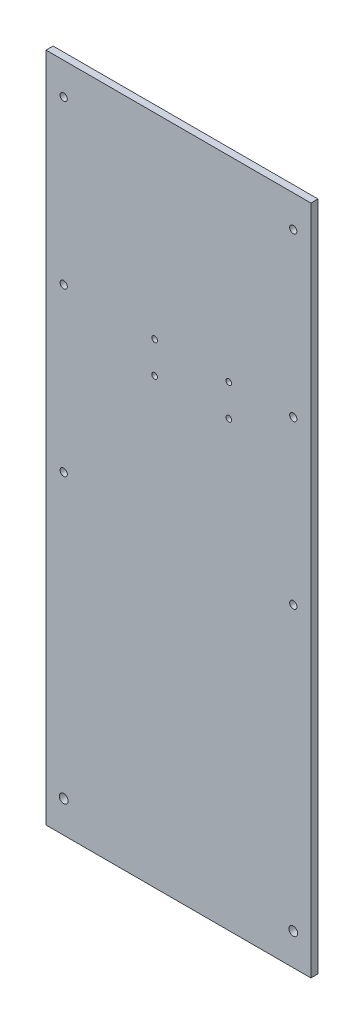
from build123d import *

# Parameters (mm, degrees)
SKETCH_1_W          = 150
SKETCH_1_H          = 380
EXTRUDE_1_DEPTH     = 4
SKETCH_2_R          = 1.6
CUT_EXTRUDE_2_DEPTH = 10
SKETCH_3_R          = 2.05
SKETCH_3_R_2        = 2.5
CUT_EXTRUDE_3_DEPTH = 205.306142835


with BuildPart() as part:
    # Sketch 1 → Extrude 1 (new body)
    with BuildSketch(Plane.XY):
        Rectangle(SKETCH_1_W, SKETCH_1_H)
    extrude(amount=EXTRUDE_1_DEPTH)

    # Sketch 2 → Cut-Extrude 2 (cut)
    with BuildSketch(Plane(origin=(0, 0, 0), x_dir=(-1, 0, 0), z_dir=(0, 0, -1))):
        with Locations((-28.5, 61)):
            Circle(SKETCH_2_R)
        with Locations((13.5, 61)):
            Circle(SKETCH_2_R)
        with Locations((13.5, 79)):
            Circle(SKETCH_2_R)
        with Locations((-28.5, 79)):
            Circle(SKETCH_2_R)
    extrude(amount=-CUT_EXTRUDE_2_DEPTH, mode=Mode.SUBTRACT)

    # Sketch 3 → Cut-Extrude 3 (cut, through all)
    with BuildSketch(Plane(origin=(0, 0, 0), x_dir=(-1, 0, 0), z_dir=(0, 0, -1))):
        with Locations((-65, 172)):
            Circle(SKETCH_3_R)
        with Locations((-65, 80)):
            Circle(SKETCH_3_R)
        with Locations((-65, -172)):
            Circle(SKETCH_3_R_2)
        with Locations(Location((65, 80, 0), (0, 0, 180))):
            Circle(SKETCH_3_R)
        with Locations((-65, -12)):
            Circle(SKETCH_3_R)
        with Locations(Location((65, -172, 0), (0, 0, 180))):
            Circle(SKETCH_3_R_2)
        with Locations(Location((65, -12, 0), (0, 0, 180))):
            Circle(SKETCH_3_R)
        with Locations(Location((65, 172, 0), (0, 0, 180))):
            Circle(SKETCH_3_R)
    extrude(amount=-CUT_EXTRUDE_3_DEPTH, mode=Mode.SUBTRACT)


solid = part.part
